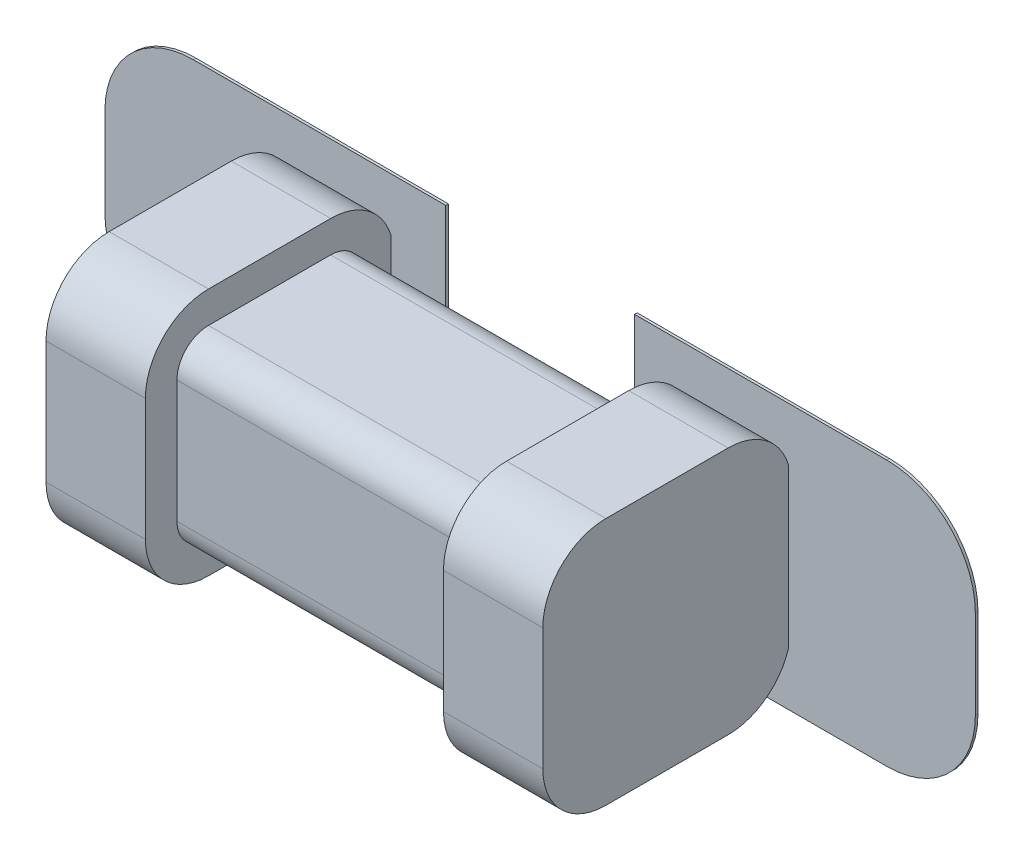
ISO-10303-21;
HEADER;
FILE_DESCRIPTION(('STEP AP214'),'2;1');
FILE_NAME('part.step','',(''),(''),'','','');
FILE_SCHEMA(('AUTOMOTIVE_DESIGN { 1 0 10303 214 1 1 1 1 }'));
ENDSEC;
DATA;
#1=APPLICATION_CONTEXT('core data for automotive mechanical design processes');
#2=APPLICATION_PROTOCOL_DEFINITION('international standard','automotive_design',2000,#1);
#3=PRODUCT_CONTEXT('',#1,'mechanical');
#4=PRODUCT('Part','Part','',(#3));
#5=PRODUCT_RELATED_PRODUCT_CATEGORY('part','',(#4));
#6=PRODUCT_DEFINITION_FORMATION('','',#4);
#7=PRODUCT_DEFINITION_CONTEXT('part definition',#1,'design');
#8=PRODUCT_DEFINITION('design','',#6,#7);
#9=PRODUCT_DEFINITION_SHAPE('','',#8);
#10=(LENGTH_UNIT() NAMED_UNIT(*) SI_UNIT(.MILLI.,.METRE.));
#11=(NAMED_UNIT(*) PLANE_ANGLE_UNIT() SI_UNIT($,.RADIAN.));
#12=(NAMED_UNIT(*) SI_UNIT($,.STERADIAN.) SOLID_ANGLE_UNIT());
#13=UNCERTAINTY_MEASURE_WITH_UNIT(LENGTH_MEASURE(1.E-05),#10,'distance_accuracy_value','');
#14=(GEOMETRIC_REPRESENTATION_CONTEXT(3) GLOBAL_UNCERTAINTY_ASSIGNED_CONTEXT((#13)) GLOBAL_UNIT_ASSIGNED_CONTEXT((#10,
#11,#12)) REPRESENTATION_CONTEXT('',''));
#15=CARTESIAN_POINT('',(0.,0.,0.));
#16=DIRECTION('',(0.,0.,1.));
#17=DIRECTION('',(1.,0.,0.));
#18=AXIS2_PLACEMENT_3D('',#15,#16,#17);
#19=CARTESIAN_POINT('',(0.,0.,0.0762));
#20=DIRECTION('',(0.,0.,1.));
#21=DIRECTION('',(1.,0.,0.));
#22=AXIS2_PLACEMENT_3D('',#19,#20,#21);
#23=PLANE('',#22);
#24=CARTESIAN_POINT('',(-0.698058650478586,-0.0890682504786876,0.0762));
#25=DIRECTION('',(0.,0.,1.));
#26=DIRECTION('',(1.,0.,0.));
#27=AXIS2_PLACEMENT_3D('',#24,#25,#26);
#28=CIRCLE('',#27,0.177936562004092);
#29=CARTESIAN_POINT('',(-0.875995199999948,-0.0890016,0.0762));
#30=VERTEX_POINT('',#29);
#31=CARTESIAN_POINT('',(-0.697992,-0.267004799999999,0.0762));
#32=VERTEX_POINT('',#31);
#33=EDGE_CURVE('E268',#30,#32,#28,.T.);
#34=ORIENTED_EDGE('',*,*,#33,.F.);
#35=DIRECTION('',(0.,1.,0.));
#36=VECTOR('',#35,1.);
#37=CARTESIAN_POINT('',(-0.8759952,0.0890016,0.0762));
#38=LINE('',#37,#36);
#39=CARTESIAN_POINT('',(-0.875995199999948,0.0890016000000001,0.0762));
#40=VERTEX_POINT('',#39);
#41=EDGE_CURVE('E262',#40,#30,#38,.F.);
#42=ORIENTED_EDGE('',*,*,#41,.F.);
#43=CARTESIAN_POINT('',(-0.698058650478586,0.0890682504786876,0.0762));
#44=DIRECTION('',(0.,0.,1.));
#45=DIRECTION('',(1.,0.,0.));
#46=AXIS2_PLACEMENT_3D('',#43,#44,#45);
#47=CIRCLE('',#46,0.177936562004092);
#48=CARTESIAN_POINT('',(-0.697992,0.267004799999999,0.0762));
#49=VERTEX_POINT('',#48);
#50=EDGE_CURVE('E19',#49,#40,#47,.T.);
#51=ORIENTED_EDGE('',*,*,#50,.F.);
#52=DIRECTION('',(1.,0.,0.));
#53=VECTOR('',#52,1.);
#54=CARTESIAN_POINT('',(-0.189992,0.2670048,0.0762));
#55=LINE('',#54,#53);
#56=CARTESIAN_POINT('',(-0.189992,0.2670048,0.0762));
#57=VERTEX_POINT('',#56);
#58=EDGE_CURVE('E245',#57,#49,#55,.F.);
#59=ORIENTED_EDGE('',*,*,#58,.F.);
#60=DIRECTION('',(0.,1.,0.));
#61=VECTOR('',#60,1.);
#62=CARTESIAN_POINT('',(-0.189992,-0.2670048,0.0762));
#63=LINE('',#62,#61);
#64=CARTESIAN_POINT('',(-0.189992,-0.2670048,0.0762));
#65=VERTEX_POINT('',#64);
#66=EDGE_CURVE('E408',#65,#57,#63,.T.);
#67=ORIENTED_EDGE('',*,*,#66,.F.);
#68=DIRECTION('',(1.,0.,0.));
#69=VECTOR('',#68,1.);
#70=CARTESIAN_POINT('',(-0.697992,-0.2670048,0.0762));
#71=LINE('',#70,#69);
#72=EDGE_CURVE('E395',#32,#65,#71,.T.);
#73=ORIENTED_EDGE('',*,*,#72,.F.);
#74=EDGE_LOOP('',(#34,#42,#51,#59,#67,#73));
#75=FACE_BOUND('',#74,.T.);
#76=ADVANCED_FACE('F16',(#75),#23,.F.);
#77=CARTESIAN_POINT('',(-0.189992,0.2670048,0.0762));
#78=DIRECTION('',(0.,1.,0.));
#79=DIRECTION('',(0.,0.,1.));
#80=AXIS2_PLACEMENT_3D('',#77,#78,#79);
#81=PLANE('',#80);
#82=DIRECTION('',(0.,0.,-1.));
#83=VECTOR('',#82,1.);
#84=CARTESIAN_POINT('',(-0.189992,0.2670048,0.0762));
#85=LINE('',#84,#83);
#86=CARTESIAN_POINT('',(-0.189992,0.2670048,0.081534));
#87=VERTEX_POINT('',#86);
#88=EDGE_CURVE('E399',#57,#87,#85,.F.);
#89=ORIENTED_EDGE('',*,*,#88,.F.);
#90=ORIENTED_EDGE('',*,*,#58,.T.);
#91=DIRECTION('',(0.,0.,1.));
#92=VECTOR('',#91,1.);
#93=CARTESIAN_POINT('',(-0.697992,0.267004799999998,0.0762));
#94=LINE('',#93,#92);
#95=CARTESIAN_POINT('',(-0.697992,0.267004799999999,0.081534));
#96=VERTEX_POINT('',#95);
#97=EDGE_CURVE('E256',#96,#49,#94,.F.);
#98=ORIENTED_EDGE('',*,*,#97,.F.);
#99=DIRECTION('',(1.,0.,0.));
#100=VECTOR('',#99,1.);
#101=CARTESIAN_POINT('',(0.,0.2670048,0.081534));
#102=LINE('',#101,#100);
#103=EDGE_CURVE('E390',#87,#96,#102,.F.);
#104=ORIENTED_EDGE('',*,*,#103,.F.);
#105=EDGE_LOOP('',(#89,#90,#98,#104));
#106=FACE_BOUND('',#105,.T.);
#107=ADVANCED_FACE('F457',(#106),#81,.T.);
#108=CARTESIAN_POINT('',(-0.698058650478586,0.0890682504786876,0.0762));
#109=DIRECTION('',(0.,0.,1.));
#110=DIRECTION('',(1.,0.,0.));
#111=AXIS2_PLACEMENT_3D('',#108,#109,#110);
#112=CYLINDRICAL_SURFACE('',#111,0.177936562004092);
#113=ORIENTED_EDGE('',*,*,#97,.T.);
#114=ORIENTED_EDGE('',*,*,#50,.T.);
#115=DIRECTION('',(0.,0.,1.));
#116=VECTOR('',#115,1.);
#117=CARTESIAN_POINT('',(-0.8759952,0.0890016,0.0762));
#118=LINE('',#117,#116);
#119=CARTESIAN_POINT('',(-0.875995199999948,0.0890016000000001,0.081534));
#120=VERTEX_POINT('',#119);
#121=EDGE_CURVE('E254',#120,#40,#118,.F.);
#122=ORIENTED_EDGE('',*,*,#121,.F.);
#123=CARTESIAN_POINT('',(-0.698058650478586,0.0890682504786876,0.081534));
#124=DIRECTION('',(0.,0.,1.));
#125=DIRECTION('',(1.,0.,0.));
#126=AXIS2_PLACEMENT_3D('',#123,#124,#125);
#127=CIRCLE('',#126,0.177936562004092);
#128=EDGE_CURVE('E389',#96,#120,#127,.T.);
#129=ORIENTED_EDGE('',*,*,#128,.F.);
#130=EDGE_LOOP('',(#113,#114,#122,#129));
#131=FACE_BOUND('',#130,.T.);
#132=ADVANCED_FACE('F252',(#131),#112,.T.);
#133=CARTESIAN_POINT('',(-0.8759952,0.0890016,0.0762));
#134=DIRECTION('',(-1.,0.,0.));
#135=DIRECTION('',(0.,0.,1.));
#136=AXIS2_PLACEMENT_3D('',#133,#134,#135);
#137=PLANE('',#136);
#138=ORIENTED_EDGE('',*,*,#121,.T.);
#139=ORIENTED_EDGE('',*,*,#41,.T.);
#140=DIRECTION('',(0.,0.,1.));
#141=VECTOR('',#140,1.);
#142=CARTESIAN_POINT('',(-0.875995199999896,-0.0890016,0.0762));
#143=LINE('',#142,#141);
#144=CARTESIAN_POINT('',(-0.875995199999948,-0.0890016,0.081534));
#145=VERTEX_POINT('',#144);
#146=EDGE_CURVE('E269',#145,#30,#143,.F.);
#147=ORIENTED_EDGE('',*,*,#146,.F.);
#148=DIRECTION('',(0.,1.,0.));
#149=VECTOR('',#148,1.);
#150=CARTESIAN_POINT('',(-0.8759952,0.,0.081534));
#151=LINE('',#150,#149);
#152=EDGE_CURVE('E264',#120,#145,#151,.F.);
#153=ORIENTED_EDGE('',*,*,#152,.F.);
#154=EDGE_LOOP('',(#138,#139,#147,#153));
#155=FACE_BOUND('',#154,.T.);
#156=ADVANCED_FACE('F260',(#155),#137,.T.);
#157=CARTESIAN_POINT('',(-0.698058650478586,-0.0890682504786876,0.0762));
#158=DIRECTION('',(0.,0.,1.));
#159=DIRECTION('',(1.,0.,0.));
#160=AXIS2_PLACEMENT_3D('',#157,#158,#159);
#161=CYLINDRICAL_SURFACE('',#160,0.177936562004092);
#162=ORIENTED_EDGE('',*,*,#146,.T.);
#163=ORIENTED_EDGE('',*,*,#33,.T.);
#164=DIRECTION('',(0.,0.,-1.));
#165=VECTOR('',#164,1.);
#166=CARTESIAN_POINT('',(-0.697992,-0.2670048,0.0762));
#167=LINE('',#166,#165);
#168=CARTESIAN_POINT('',(-0.697992,-0.267004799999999,0.081534));
#169=VERTEX_POINT('',#168);
#170=EDGE_CURVE('E391',#169,#32,#167,.T.);
#171=ORIENTED_EDGE('',*,*,#170,.F.);
#172=CARTESIAN_POINT('',(-0.698058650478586,-0.0890682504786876,0.081534));
#173=DIRECTION('',(0.,0.,1.));
#174=DIRECTION('',(1.,0.,0.));
#175=AXIS2_PLACEMENT_3D('',#172,#173,#174);
#176=CIRCLE('',#175,0.177936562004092);
#177=EDGE_CURVE('E386',#145,#169,#176,.T.);
#178=ORIENTED_EDGE('',*,*,#177,.F.);
#179=EDGE_LOOP('',(#162,#163,#171,#178));
#180=FACE_BOUND('',#179,.T.);
#181=ADVANCED_FACE('F458',(#180),#161,.T.);
#182=CARTESIAN_POINT('',(-0.697992,-0.2670048,0.0762));
#183=DIRECTION('',(0.,-1.,0.));
#184=DIRECTION('',(0.,0.,-1.));
#185=AXIS2_PLACEMENT_3D('',#182,#183,#184);
#186=PLANE('',#185);
#187=ORIENTED_EDGE('',*,*,#170,.T.);
#188=ORIENTED_EDGE('',*,*,#72,.T.);
#189=DIRECTION('',(0.,0.,-1.));
#190=VECTOR('',#189,1.);
#191=CARTESIAN_POINT('',(-0.189992,-0.2670048,0.0762));
#192=LINE('',#191,#190);
#193=CARTESIAN_POINT('',(-0.189992,-0.2670048,0.081534));
#194=VERTEX_POINT('',#193);
#195=EDGE_CURVE('E405',#194,#65,#192,.T.);
#196=ORIENTED_EDGE('',*,*,#195,.F.);
#197=DIRECTION('',(1.,0.,0.));
#198=VECTOR('',#197,1.);
#199=CARTESIAN_POINT('',(0.,-0.2670048,0.081534));
#200=LINE('',#199,#198);
#201=EDGE_CURVE('E388',#169,#194,#200,.T.);
#202=ORIENTED_EDGE('',*,*,#201,.F.);
#203=EDGE_LOOP('',(#187,#188,#196,#202));
#204=FACE_BOUND('',#203,.T.);
#205=ADVANCED_FACE('F455',(#204),#186,.T.);
#206=CARTESIAN_POINT('',(-0.189992,-0.2670048,0.0762));
#207=DIRECTION('',(1.,0.,0.));
#208=DIRECTION('',(0.,0.,-1.));
#209=AXIS2_PLACEMENT_3D('',#206,#207,#208);
#210=PLANE('',#209);
#211=ORIENTED_EDGE('',*,*,#195,.T.);
#212=ORIENTED_EDGE('',*,*,#66,.T.);
#213=ORIENTED_EDGE('',*,*,#88,.T.);
#214=DIRECTION('',(0.,1.,0.));
#215=VECTOR('',#214,1.);
#216=CARTESIAN_POINT('',(-0.189992,0.,0.081534));
#217=LINE('',#216,#215);
#218=EDGE_CURVE('E411',#194,#87,#217,.T.);
#219=ORIENTED_EDGE('',*,*,#218,.F.);
#220=EDGE_LOOP('',(#211,#212,#213,#219));
#221=FACE_BOUND('',#220,.T.);
#222=ADVANCED_FACE('F456',(#221),#210,.T.);
#223=CARTESIAN_POINT('',(-0.500000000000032,0.249999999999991,0.0762));
#224=DIRECTION('',(-1.,0.,0.));
#225=DIRECTION('',(0.,0.,1.));
#226=AXIS2_PLACEMENT_3D('',#223,#224,#225);
#227=PLANE('',#226);
#228=CARTESIAN_POINT('',(-0.500000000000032,0.122999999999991,0.2032));
#229=DIRECTION('',(1.,0.,0.));
#230=DIRECTION('',(0.,0.,-1.));
#231=AXIS2_PLACEMENT_3D('',#228,#229,#230);
#232=CIRCLE('',#231,0.127);
#233=CARTESIAN_POINT('',(-0.500000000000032,0.15941956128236,0.0815340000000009));
#234=VERTEX_POINT('',#233);
#235=CARTESIAN_POINT('',(-0.500000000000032,0.249999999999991,0.2032));
#236=VERTEX_POINT('',#235);
#237=EDGE_CURVE('E369',#234,#236,#232,.T.);
#238=ORIENTED_EDGE('',*,*,#237,.F.);
#239=DIRECTION('',(0.,1.,0.));
#240=VECTOR('',#239,1.);
#241=CARTESIAN_POINT('',(-0.500000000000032,0.,0.081534));
#242=LINE('',#241,#240);
#243=CARTESIAN_POINT('',(-0.500000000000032,-0.15941956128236,0.0815340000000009));
#244=VERTEX_POINT('',#243);
#245=EDGE_CURVE('E385',#244,#234,#242,.T.);
#246=ORIENTED_EDGE('',*,*,#245,.F.);
#247=CARTESIAN_POINT('',(-0.500000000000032,-0.122999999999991,0.2032));
#248=DIRECTION('',(1.,0.,0.));
#249=DIRECTION('',(0.,0.,-1.));
#250=AXIS2_PLACEMENT_3D('',#247,#248,#249);
#251=CIRCLE('',#250,0.127);
#252=CARTESIAN_POINT('',(-0.500000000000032,-0.249999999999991,0.2032));
#253=VERTEX_POINT('',#252);
#254=EDGE_CURVE('E382',#253,#244,#251,.T.);
#255=ORIENTED_EDGE('',*,*,#254,.F.);
#256=DIRECTION('',(0.,0.,-1.));
#257=VECTOR('',#256,1.);
#258=CARTESIAN_POINT('',(-0.500000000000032,-0.249999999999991,0.0762));
#259=LINE('',#258,#257);
#260=CARTESIAN_POINT('',(-0.500000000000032,-0.249999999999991,0.449072));
#261=VERTEX_POINT('',#260);
#262=EDGE_CURVE('E403',#261,#253,#259,.T.);
#263=ORIENTED_EDGE('',*,*,#262,.F.);
#264=CARTESIAN_POINT('',(-0.500000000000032,-0.122999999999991,0.449072));
#265=DIRECTION('',(1.,0.,0.));
#266=DIRECTION('',(0.,0.,-1.));
#267=AXIS2_PLACEMENT_3D('',#264,#265,#266);
#268=CIRCLE('',#267,0.127);
#269=CARTESIAN_POINT('',(-0.500000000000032,-0.122999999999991,0.576072));
#270=VERTEX_POINT('',#269);
#271=EDGE_CURVE('E378',#270,#261,#268,.T.);
#272=ORIENTED_EDGE('',*,*,#271,.F.);
#273=DIRECTION('',(0.,1.,0.));
#274=VECTOR('',#273,1.);
#275=CARTESIAN_POINT('',(-0.500000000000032,0.,0.576072));
#276=LINE('',#275,#274);
#277=CARTESIAN_POINT('',(-0.500000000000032,0.122999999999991,0.576072));
#278=VERTEX_POINT('',#277);
#279=EDGE_CURVE('E436',#278,#270,#276,.F.);
#280=ORIENTED_EDGE('',*,*,#279,.F.);
#281=CARTESIAN_POINT('',(-0.500000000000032,0.122999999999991,0.449072));
#282=DIRECTION('',(-1.,0.,0.));
#283=DIRECTION('',(0.,0.,1.));
#284=AXIS2_PLACEMENT_3D('',#281,#282,#283);
#285=CIRCLE('',#284,0.127);
#286=CARTESIAN_POINT('',(-0.500000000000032,0.249999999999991,0.449072));
#287=VERTEX_POINT('',#286);
#288=EDGE_CURVE('E373',#287,#278,#285,.F.);
#289=ORIENTED_EDGE('',*,*,#288,.F.);
#290=DIRECTION('',(0.,0.,1.));
#291=VECTOR('',#290,1.);
#292=CARTESIAN_POINT('',(-0.500000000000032,0.249999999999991,0.0762));
#293=LINE('',#292,#291);
#294=EDGE_CURVE('E376',#236,#287,#293,.T.);
#295=ORIENTED_EDGE('',*,*,#294,.F.);
#296=EDGE_LOOP('',(#238,#246,#255,#263,#272,#280,#289,#295));
#297=FACE_BOUND('',#296,.T.);
#298=ADVANCED_FACE('F603',(#297),#227,.T.);
#299=CARTESIAN_POINT('',(0.,0.,0.081534));
#300=DIRECTION('',(0.,0.,1.));
#301=DIRECTION('',(1.,0.,0.));
#302=AXIS2_PLACEMENT_3D('',#299,#300,#301);
#303=PLANE('',#302);
#304=DIRECTION('',(1.,0.,0.));
#305=VECTOR('',#304,1.);
#306=CARTESIAN_POINT('',(0.500000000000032,-0.159419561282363,0.0815340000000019));
#307=LINE('',#306,#305);
#308=CARTESIAN_POINT('',(-0.30000000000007,-0.15941956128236,0.0815340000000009));
#309=VERTEX_POINT('',#308);
#310=EDGE_CURVE('E384',#244,#309,#307,.T.);
#311=ORIENTED_EDGE('',*,*,#310,.F.);
#312=ORIENTED_EDGE('',*,*,#245,.T.);
#313=DIRECTION('',(1.,0.,0.));
#314=VECTOR('',#313,1.);
#315=CARTESIAN_POINT('',(0.500000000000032,0.159419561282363,0.0815340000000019));
#316=LINE('',#315,#314);
#317=CARTESIAN_POINT('',(-0.30000000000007,0.15941956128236,0.0815340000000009));
#318=VERTEX_POINT('',#317);
#319=EDGE_CURVE('E950',#318,#234,#316,.F.);
#320=ORIENTED_EDGE('',*,*,#319,.F.);
#321=DIRECTION('',(0.,1.,0.));
#322=VECTOR('',#321,1.);
#323=CARTESIAN_POINT('',(-0.30000000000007,0.249999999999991,0.081534));
#324=LINE('',#323,#322);
#325=EDGE_CURVE('E368',#318,#309,#324,.F.);
#326=ORIENTED_EDGE('',*,*,#325,.T.);
#327=EDGE_LOOP('',(#311,#312,#320,#326));
#328=FACE_BOUND('',#327,.T.);
#329=ORIENTED_EDGE('',*,*,#201,.T.);
#330=ORIENTED_EDGE('',*,*,#218,.T.);
#331=ORIENTED_EDGE('',*,*,#103,.T.);
#332=ORIENTED_EDGE('',*,*,#128,.T.);
#333=ORIENTED_EDGE('',*,*,#152,.T.);
#334=ORIENTED_EDGE('',*,*,#177,.T.);
#335=EDGE_LOOP('',(#329,#330,#331,#332,#333,#334));
#336=FACE_BOUND('',#335,.T.);
#337=ADVANCED_FACE('F452',(#328,#336),#303,.T.);
#338=CARTESIAN_POINT('',(0.500000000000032,-0.122999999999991,0.2032));
#339=DIRECTION('',(1.,0.,0.));
#340=DIRECTION('',(0.,0.,-1.));
#341=AXIS2_PLACEMENT_3D('',#338,#339,#340);
#342=CYLINDRICAL_SURFACE('',#341,0.127);
#343=ORIENTED_EDGE('',*,*,#254,.T.);
#344=ORIENTED_EDGE('',*,*,#310,.T.);
#345=CARTESIAN_POINT('',(-0.30000000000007,-0.122999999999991,0.2032));
#346=DIRECTION('',(1.,0.,0.));
#347=DIRECTION('',(0.,0.,-1.));
#348=AXIS2_PLACEMENT_3D('',#345,#346,#347);
#349=CIRCLE('',#348,0.127);
#350=CARTESIAN_POINT('',(-0.30000000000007,-0.249999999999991,0.2032));
#351=VERTEX_POINT('',#350);
#352=EDGE_CURVE('E365',#309,#351,#349,.F.);
#353=ORIENTED_EDGE('',*,*,#352,.T.);
#354=DIRECTION('',(1.,0.,0.));
#355=VECTOR('',#354,1.);
#356=CARTESIAN_POINT('',(-0.500000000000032,-0.249999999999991,0.2032));
#357=LINE('',#356,#355);
#358=EDGE_CURVE('E381',#253,#351,#357,.T.);
#359=ORIENTED_EDGE('',*,*,#358,.F.);
#360=EDGE_LOOP('',(#343,#344,#353,#359));
#361=FACE_BOUND('',#360,.T.);
#362=ADVANCED_FACE('F596',(#361),#342,.T.);
#363=CARTESIAN_POINT('',(-0.500000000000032,-0.249999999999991,0.0762));
#364=DIRECTION('',(0.,-1.,0.));
#365=DIRECTION('',(0.,0.,-1.));
#366=AXIS2_PLACEMENT_3D('',#363,#364,#365);
#367=PLANE('',#366);
#368=ORIENTED_EDGE('',*,*,#262,.T.);
#369=ORIENTED_EDGE('',*,*,#358,.T.);
#370=DIRECTION('',(0.,0.,1.));
#371=VECTOR('',#370,1.);
#372=CARTESIAN_POINT('',(-0.30000000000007,-0.249999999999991,0.0762));
#373=LINE('',#372,#371);
#374=CARTESIAN_POINT('',(-0.30000000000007,-0.249999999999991,0.449072));
#375=VERTEX_POINT('',#374);
#376=EDGE_CURVE('E364',#351,#375,#373,.T.);
#377=ORIENTED_EDGE('',*,*,#376,.T.);
#378=DIRECTION('',(1.,0.,0.));
#379=VECTOR('',#378,1.);
#380=CARTESIAN_POINT('',(-0.503657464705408,-0.249999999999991,0.449072));
#381=LINE('',#380,#379);
#382=EDGE_CURVE('E380',#261,#375,#381,.T.);
#383=ORIENTED_EDGE('',*,*,#382,.F.);
#384=EDGE_LOOP('',(#368,#369,#377,#383));
#385=FACE_BOUND('',#384,.T.);
#386=ADVANCED_FACE('F593',(#385),#367,.T.);
#387=CARTESIAN_POINT('',(-0.503657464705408,-0.122999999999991,0.449072));
#388=DIRECTION('',(1.,0.,0.));
#389=DIRECTION('',(0.,0.,-1.));
#390=AXIS2_PLACEMENT_3D('',#387,#388,#389);
#391=CYLINDRICAL_SURFACE('',#390,0.127);
#392=ORIENTED_EDGE('',*,*,#382,.T.);
#393=CARTESIAN_POINT('',(-0.30000000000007,-0.122999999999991,0.449072));
#394=DIRECTION('',(1.,0.,0.));
#395=DIRECTION('',(0.,0.,-1.));
#396=AXIS2_PLACEMENT_3D('',#393,#394,#395);
#397=CIRCLE('',#396,0.127);
#398=CARTESIAN_POINT('',(-0.30000000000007,-0.122999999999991,0.576072));
#399=VERTEX_POINT('',#398);
#400=EDGE_CURVE('E361',#375,#399,#397,.F.);
#401=ORIENTED_EDGE('',*,*,#400,.T.);
#402=DIRECTION('',(1.,0.,0.));
#403=VECTOR('',#402,1.);
#404=CARTESIAN_POINT('',(0.,-0.122999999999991,0.576072));
#405=LINE('',#404,#403);
#406=EDGE_CURVE('E437',#270,#399,#405,.T.);
#407=ORIENTED_EDGE('',*,*,#406,.F.);
#408=ORIENTED_EDGE('',*,*,#271,.T.);
#409=EDGE_LOOP('',(#392,#401,#407,#408));
#410=FACE_BOUND('',#409,.T.);
#411=ADVANCED_FACE('F590',(#410),#391,.T.);
#412=CARTESIAN_POINT('',(0.,0.,0.576072));
#413=DIRECTION('',(0.,0.,1.));
#414=DIRECTION('',(1.,0.,0.));
#415=AXIS2_PLACEMENT_3D('',#412,#413,#414);
#416=PLANE('',#415);
#417=DIRECTION('',(0.,1.,0.));
#418=VECTOR('',#417,1.);
#419=CARTESIAN_POINT('',(-0.30000000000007,0.249999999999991,0.576072));
#420=LINE('',#419,#418);
#421=CARTESIAN_POINT('',(-0.30000000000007,0.122999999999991,0.576072));
#422=VERTEX_POINT('',#421);
#423=EDGE_CURVE('E360',#399,#422,#420,.T.);
#424=ORIENTED_EDGE('',*,*,#423,.T.);
#425=DIRECTION('',(-1.,0.,0.));
#426=VECTOR('',#425,1.);
#427=CARTESIAN_POINT('',(0.503516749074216,0.122999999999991,0.576072));
#428=LINE('',#427,#426);
#429=EDGE_CURVE('E377',#278,#422,#428,.F.);
#430=ORIENTED_EDGE('',*,*,#429,.F.);
#431=ORIENTED_EDGE('',*,*,#279,.T.);
#432=ORIENTED_EDGE('',*,*,#406,.T.);
#433=EDGE_LOOP('',(#424,#430,#431,#432));
#434=FACE_BOUND('',#433,.T.);
#435=ADVANCED_FACE('F586',(#434),#416,.T.);
#436=CARTESIAN_POINT('',(0.503516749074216,0.122999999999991,0.449072));
#437=DIRECTION('',(-1.,0.,0.));
#438=DIRECTION('',(0.,0.,1.));
#439=AXIS2_PLACEMENT_3D('',#436,#437,#438);
#440=CYLINDRICAL_SURFACE('',#439,0.127);
#441=DIRECTION('',(1.,0.,0.));
#442=VECTOR('',#441,1.);
#443=CARTESIAN_POINT('',(0.500000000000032,0.249999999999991,0.449072));
#444=LINE('',#443,#442);
#445=CARTESIAN_POINT('',(-0.30000000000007,0.249999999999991,0.449072));
#446=VERTEX_POINT('',#445);
#447=EDGE_CURVE('E372',#287,#446,#444,.T.);
#448=ORIENTED_EDGE('',*,*,#447,.F.);
#449=ORIENTED_EDGE('',*,*,#288,.T.);
#450=ORIENTED_EDGE('',*,*,#429,.T.);
#451=CARTESIAN_POINT('',(-0.30000000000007,0.122999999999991,0.449072));
#452=DIRECTION('',(-1.,0.,0.));
#453=DIRECTION('',(0.,0.,1.));
#454=AXIS2_PLACEMENT_3D('',#451,#452,#453);
#455=CIRCLE('',#454,0.127);
#456=EDGE_CURVE('E357',#422,#446,#455,.T.);
#457=ORIENTED_EDGE('',*,*,#456,.T.);
#458=EDGE_LOOP('',(#448,#449,#450,#457));
#459=FACE_BOUND('',#458,.T.);
#460=ADVANCED_FACE('F582',(#459),#440,.T.);
#461=CARTESIAN_POINT('',(0.500000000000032,0.249999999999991,0.0762));
#462=DIRECTION('',(0.,1.,0.));
#463=DIRECTION('',(0.,0.,1.));
#464=AXIS2_PLACEMENT_3D('',#461,#462,#463);
#465=PLANE('',#464);
#466=DIRECTION('',(0.,0.,1.));
#467=VECTOR('',#466,1.);
#468=CARTESIAN_POINT('',(-0.30000000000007,0.249999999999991,0.0762));
#469=LINE('',#468,#467);
#470=CARTESIAN_POINT('',(-0.30000000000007,0.249999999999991,0.2032));
#471=VERTEX_POINT('',#470);
#472=EDGE_CURVE('E356',#446,#471,#469,.F.);
#473=ORIENTED_EDGE('',*,*,#472,.T.);
#474=DIRECTION('',(1.,0.,0.));
#475=VECTOR('',#474,1.);
#476=CARTESIAN_POINT('',(0.500000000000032,0.249999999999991,0.2032));
#477=LINE('',#476,#475);
#478=EDGE_CURVE('E371',#236,#471,#477,.T.);
#479=ORIENTED_EDGE('',*,*,#478,.F.);
#480=ORIENTED_EDGE('',*,*,#294,.T.);
#481=ORIENTED_EDGE('',*,*,#447,.T.);
#482=EDGE_LOOP('',(#473,#479,#480,#481));
#483=FACE_BOUND('',#482,.T.);
#484=ADVANCED_FACE('F578',(#483),#465,.T.);
#485=CARTESIAN_POINT('',(0.500000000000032,0.122999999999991,0.2032));
#486=DIRECTION('',(1.,0.,0.));
#487=DIRECTION('',(0.,0.,-1.));
#488=AXIS2_PLACEMENT_3D('',#485,#486,#487);
#489=CYLINDRICAL_SURFACE('',#488,0.127);
#490=CARTESIAN_POINT('',(-0.30000000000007,0.122999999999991,0.2032));
#491=DIRECTION('',(1.,0.,0.));
#492=DIRECTION('',(0.,0.,-1.));
#493=AXIS2_PLACEMENT_3D('',#490,#491,#492);
#494=CIRCLE('',#493,0.127);
#495=EDGE_CURVE('E353',#471,#318,#494,.F.);
#496=ORIENTED_EDGE('',*,*,#495,.T.);
#497=ORIENTED_EDGE('',*,*,#319,.T.);
#498=ORIENTED_EDGE('',*,*,#237,.T.);
#499=ORIENTED_EDGE('',*,*,#478,.T.);
#500=EDGE_LOOP('',(#496,#497,#498,#499));
#501=FACE_BOUND('',#500,.T.);
#502=ADVANCED_FACE('F574',(#501),#489,.T.);
#503=CARTESIAN_POINT('',(-0.30000000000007,0.249999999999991,0.0762));
#504=DIRECTION('',(-1.,0.,0.));
#505=DIRECTION('',(0.,0.,1.));
#506=AXIS2_PLACEMENT_3D('',#503,#504,#505);
#507=PLANE('',#506);
#508=DIRECTION('',(0.,1.,0.));
#509=VECTOR('',#508,1.);
#510=CARTESIAN_POINT('',(-0.30000000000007,0.249999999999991,0.1397));
#511=LINE('',#510,#509);
#512=CARTESIAN_POINT('',(-0.30000000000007,0.122999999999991,0.1397));
#513=VERTEX_POINT('',#512);
#514=CARTESIAN_POINT('',(-0.30000000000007,-0.122999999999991,0.1397));
#515=VERTEX_POINT('',#514);
#516=EDGE_CURVE('E344',#513,#515,#511,.F.);
#517=ORIENTED_EDGE('',*,*,#516,.T.);
#518=CARTESIAN_POINT('',(-0.30000000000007,-0.122999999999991,0.2032));
#519=DIRECTION('',(1.,0.,0.));
#520=DIRECTION('',(0.,0.,-1.));
#521=AXIS2_PLACEMENT_3D('',#518,#519,#520);
#522=CIRCLE('',#521,0.0635);
#523=CARTESIAN_POINT('',(-0.30000000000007,-0.186499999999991,0.2032));
#524=VERTEX_POINT('',#523);
#525=EDGE_CURVE('E341',#524,#515,#522,.T.);
#526=ORIENTED_EDGE('',*,*,#525,.F.);
#527=DIRECTION('',(0.,0.,1.));
#528=VECTOR('',#527,1.);
#529=CARTESIAN_POINT('',(-0.30000000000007,-0.186499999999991,0.0762));
#530=LINE('',#529,#528);
#531=CARTESIAN_POINT('',(-0.30000000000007,-0.186499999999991,0.449072));
#532=VERTEX_POINT('',#531);
#533=EDGE_CURVE('E340',#524,#532,#530,.T.);
#534=ORIENTED_EDGE('',*,*,#533,.T.);
#535=CARTESIAN_POINT('',(-0.30000000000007,-0.122999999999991,0.449072));
#536=DIRECTION('',(-1.,0.,0.));
#537=DIRECTION('',(0.,0.,1.));
#538=AXIS2_PLACEMENT_3D('',#535,#536,#537);
#539=CIRCLE('',#538,0.0635);
#540=CARTESIAN_POINT('',(-0.30000000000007,-0.122999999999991,0.512572));
#541=VERTEX_POINT('',#540);
#542=EDGE_CURVE('E337',#541,#532,#539,.F.);
#543=ORIENTED_EDGE('',*,*,#542,.F.);
#544=DIRECTION('',(0.,1.,0.));
#545=VECTOR('',#544,1.);
#546=CARTESIAN_POINT('',(-0.30000000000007,0.249999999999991,0.512572));
#547=LINE('',#546,#545);
#548=CARTESIAN_POINT('',(-0.30000000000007,0.122999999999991,0.512572));
#549=VERTEX_POINT('',#548);
#550=EDGE_CURVE('E352',#541,#549,#547,.T.);
#551=ORIENTED_EDGE('',*,*,#550,.T.);
#552=CARTESIAN_POINT('',(-0.30000000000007,0.122999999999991,0.449072));
#553=DIRECTION('',(1.,0.,0.));
#554=DIRECTION('',(0.,0.,-1.));
#555=AXIS2_PLACEMENT_3D('',#552,#553,#554);
#556=CIRCLE('',#555,0.0635);
#557=CARTESIAN_POINT('',(-0.30000000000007,0.186499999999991,0.449072));
#558=VERTEX_POINT('',#557);
#559=EDGE_CURVE('E349',#558,#549,#556,.T.);
#560=ORIENTED_EDGE('',*,*,#559,.F.);
#561=DIRECTION('',(0.,0.,-1.));
#562=VECTOR('',#561,1.);
#563=CARTESIAN_POINT('',(-0.30000000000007,0.186499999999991,0.0762));
#564=LINE('',#563,#562);
#565=CARTESIAN_POINT('',(-0.30000000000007,0.186499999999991,0.2032));
#566=VERTEX_POINT('',#565);
#567=EDGE_CURVE('E348',#558,#566,#564,.T.);
#568=ORIENTED_EDGE('',*,*,#567,.T.);
#569=CARTESIAN_POINT('',(-0.30000000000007,0.122999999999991,0.2032));
#570=DIRECTION('',(-1.,0.,0.));
#571=DIRECTION('',(0.,0.,1.));
#572=AXIS2_PLACEMENT_3D('',#569,#570,#571);
#573=CIRCLE('',#572,0.0635);
#574=EDGE_CURVE('E345',#513,#566,#573,.F.);
#575=ORIENTED_EDGE('',*,*,#574,.F.);
#576=EDGE_LOOP('',(#517,#526,#534,#543,#551,#560,#568,#575));
#577=FACE_BOUND('',#576,.T.);
#578=ORIENTED_EDGE('',*,*,#472,.F.);
#579=ORIENTED_EDGE('',*,*,#456,.F.);
#580=ORIENTED_EDGE('',*,*,#423,.F.);
#581=ORIENTED_EDGE('',*,*,#400,.F.);
#582=ORIENTED_EDGE('',*,*,#376,.F.);
#583=ORIENTED_EDGE('',*,*,#352,.F.);
#584=ORIENTED_EDGE('',*,*,#325,.F.);
#585=ORIENTED_EDGE('',*,*,#495,.F.);
#586=EDGE_LOOP('',(#578,#579,#580,#581,#582,#583,#584,#585));
#587=FACE_BOUND('',#586,.T.);
#588=ADVANCED_FACE('F570',(#577,#587),#507,.F.);
#589=CARTESIAN_POINT('',(0.30000000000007,0.249999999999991,0.512572));
#590=DIRECTION('',(0.,0.,-1.));
#591=DIRECTION('',(-1.,0.,0.));
#592=AXIS2_PLACEMENT_3D('',#589,#590,#591);
#593=PLANE('',#592);
#594=DIRECTION('',(-1.,0.,0.));
#595=VECTOR('',#594,1.);
#596=CARTESIAN_POINT('',(0.303657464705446,-0.122999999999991,0.512572));
#597=LINE('',#596,#595);
#598=CARTESIAN_POINT('',(0.30000000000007,-0.122999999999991,0.512572));
#599=VERTEX_POINT('',#598);
#600=EDGE_CURVE('E993',#599,#541,#597,.T.);
#601=ORIENTED_EDGE('',*,*,#600,.F.);
#602=DIRECTION('',(0.,1.,0.));
#603=VECTOR('',#602,1.);
#604=CARTESIAN_POINT('',(0.30000000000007,0.186499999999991,0.512572));
#605=LINE('',#604,#603);
#606=CARTESIAN_POINT('',(0.30000000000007,0.122999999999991,0.512572));
#607=VERTEX_POINT('',#606);
#608=EDGE_CURVE('E324',#599,#607,#605,.T.);
#609=ORIENTED_EDGE('',*,*,#608,.T.);
#610=DIRECTION('',(1.,0.,0.));
#611=VECTOR('',#610,1.);
#612=CARTESIAN_POINT('',(-0.303833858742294,0.122999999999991,0.512572));
#613=LINE('',#612,#611);
#614=EDGE_CURVE('E351',#549,#607,#613,.T.);
#615=ORIENTED_EDGE('',*,*,#614,.F.);
#616=ORIENTED_EDGE('',*,*,#550,.F.);
#617=EDGE_LOOP('',(#601,#609,#615,#616));
#618=FACE_BOUND('',#617,.T.);
#619=ADVANCED_FACE('F566',(#618),#593,.F.);
#620=CARTESIAN_POINT('',(-0.303833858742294,0.122999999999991,0.449072));
#621=DIRECTION('',(1.,0.,0.));
#622=DIRECTION('',(0.,0.,-1.));
#623=AXIS2_PLACEMENT_3D('',#620,#621,#622);
#624=CYLINDRICAL_SURFACE('',#623,0.0635);
#625=ORIENTED_EDGE('',*,*,#559,.T.);
#626=ORIENTED_EDGE('',*,*,#614,.T.);
#627=CARTESIAN_POINT('',(0.30000000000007,0.122999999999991,0.449072));
#628=DIRECTION('',(1.,0.,0.));
#629=DIRECTION('',(0.,0.,-1.));
#630=AXIS2_PLACEMENT_3D('',#627,#628,#629);
#631=CIRCLE('',#630,0.0635);
#632=CARTESIAN_POINT('',(0.30000000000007,0.186499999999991,0.449072));
#633=VERTEX_POINT('',#632);
#634=EDGE_CURVE('E321',#607,#633,#631,.F.);
#635=ORIENTED_EDGE('',*,*,#634,.T.);
#636=DIRECTION('',(1.,0.,0.));
#637=VECTOR('',#636,1.);
#638=CARTESIAN_POINT('',(-0.30000000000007,0.186499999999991,0.449072));
#639=LINE('',#638,#637);
#640=EDGE_CURVE('E974',#633,#558,#639,.F.);
#641=ORIENTED_EDGE('',*,*,#640,.T.);
#642=EDGE_LOOP('',(#625,#626,#635,#641));
#643=FACE_BOUND('',#642,.T.);
#644=ADVANCED_FACE('F562',(#643),#624,.T.);
#645=CARTESIAN_POINT('',(-0.30000000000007,0.186499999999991,0.0762));
#646=DIRECTION('',(0.,-1.,0.));
#647=DIRECTION('',(0.,0.,-1.));
#648=AXIS2_PLACEMENT_3D('',#645,#646,#647);
#649=PLANE('',#648);
#650=ORIENTED_EDGE('',*,*,#640,.F.);
#651=DIRECTION('',(0.,0.,-1.));
#652=VECTOR('',#651,1.);
#653=CARTESIAN_POINT('',(0.30000000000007,0.186499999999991,0.0762));
#654=LINE('',#653,#652);
#655=CARTESIAN_POINT('',(0.30000000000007,0.186499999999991,0.2032));
#656=VERTEX_POINT('',#655);
#657=EDGE_CURVE('E320',#633,#656,#654,.T.);
#658=ORIENTED_EDGE('',*,*,#657,.T.);
#659=DIRECTION('',(-1.,0.,0.));
#660=VECTOR('',#659,1.);
#661=CARTESIAN_POINT('',(0.303516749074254,0.186499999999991,0.2032));
#662=LINE('',#661,#660);
#663=EDGE_CURVE('E347',#566,#656,#662,.F.);
#664=ORIENTED_EDGE('',*,*,#663,.F.);
#665=ORIENTED_EDGE('',*,*,#567,.F.);
#666=EDGE_LOOP('',(#650,#658,#664,#665));
#667=FACE_BOUND('',#666,.T.);
#668=ADVANCED_FACE('F558',(#667),#649,.F.);
#669=CARTESIAN_POINT('',(0.303516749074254,0.122999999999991,0.2032));
#670=DIRECTION('',(-1.,0.,0.));
#671=DIRECTION('',(0.,0.,1.));
#672=AXIS2_PLACEMENT_3D('',#669,#670,#671);
#673=CYLINDRICAL_SURFACE('',#672,0.0635);
#674=CARTESIAN_POINT('',(0.30000000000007,0.122999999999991,0.2032));
#675=DIRECTION('',(-1.,0.,0.));
#676=DIRECTION('',(0.,0.,1.));
#677=AXIS2_PLACEMENT_3D('',#674,#675,#676);
#678=CIRCLE('',#677,0.0635);
#679=CARTESIAN_POINT('',(0.30000000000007,0.122999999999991,0.1397));
#680=VERTEX_POINT('',#679);
#681=EDGE_CURVE('E317',#656,#680,#678,.T.);
#682=ORIENTED_EDGE('',*,*,#681,.T.);
#683=DIRECTION('',(1.,0.,0.));
#684=VECTOR('',#683,1.);
#685=CARTESIAN_POINT('',(-0.30000000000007,0.122999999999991,0.1397));
#686=LINE('',#685,#684);
#687=EDGE_CURVE('E972',#680,#513,#686,.F.);
#688=ORIENTED_EDGE('',*,*,#687,.T.);
#689=ORIENTED_EDGE('',*,*,#574,.T.);
#690=ORIENTED_EDGE('',*,*,#663,.T.);
#691=EDGE_LOOP('',(#682,#688,#689,#690));
#692=FACE_BOUND('',#691,.T.);
#693=ADVANCED_FACE('F554',(#692),#673,.T.);
#694=CARTESIAN_POINT('',(-0.30000000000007,0.249999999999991,0.1397));
#695=DIRECTION('',(0.,0.,1.));
#696=DIRECTION('',(1.,0.,0.));
#697=AXIS2_PLACEMENT_3D('',#694,#695,#696);
#698=PLANE('',#697);
#699=DIRECTION('',(1.,0.,0.));
#700=VECTOR('',#699,1.);
#701=CARTESIAN_POINT('',(-0.303516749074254,-0.122999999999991,0.1397));
#702=LINE('',#701,#700);
#703=CARTESIAN_POINT('',(0.30000000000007,-0.122999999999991,0.1397));
#704=VERTEX_POINT('',#703);
#705=EDGE_CURVE('E343',#515,#704,#702,.T.);
#706=ORIENTED_EDGE('',*,*,#705,.F.);
#707=ORIENTED_EDGE('',*,*,#516,.F.);
#708=ORIENTED_EDGE('',*,*,#687,.F.);
#709=DIRECTION('',(0.,1.,0.));
#710=VECTOR('',#709,1.);
#711=CARTESIAN_POINT('',(0.30000000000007,0.186499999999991,0.1397));
#712=LINE('',#711,#710);
#713=EDGE_CURVE('E316',#680,#704,#712,.F.);
#714=ORIENTED_EDGE('',*,*,#713,.T.);
#715=EDGE_LOOP('',(#706,#707,#708,#714));
#716=FACE_BOUND('',#715,.T.);
#717=ADVANCED_FACE('F550',(#716),#698,.F.);
#718=CARTESIAN_POINT('',(-0.303516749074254,-0.122999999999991,0.2032));
#719=DIRECTION('',(1.,0.,0.));
#720=DIRECTION('',(0.,0.,-1.));
#721=AXIS2_PLACEMENT_3D('',#718,#719,#720);
#722=CYLINDRICAL_SURFACE('',#721,0.0635);
#723=ORIENTED_EDGE('',*,*,#525,.T.);
#724=ORIENTED_EDGE('',*,*,#705,.T.);
#725=CARTESIAN_POINT('',(0.30000000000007,-0.122999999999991,0.2032));
#726=DIRECTION('',(1.,0.,0.));
#727=DIRECTION('',(0.,0.,-1.));
#728=AXIS2_PLACEMENT_3D('',#725,#726,#727);
#729=CIRCLE('',#728,0.0635);
#730=CARTESIAN_POINT('',(0.30000000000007,-0.186499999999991,0.2032));
#731=VERTEX_POINT('',#730);
#732=EDGE_CURVE('E313',#704,#731,#729,.F.);
#733=ORIENTED_EDGE('',*,*,#732,.T.);
#734=DIRECTION('',(1.,0.,0.));
#735=VECTOR('',#734,1.);
#736=CARTESIAN_POINT('',(0.30000000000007,-0.186499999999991,0.2032));
#737=LINE('',#736,#735);
#738=EDGE_CURVE('E985',#731,#524,#737,.F.);
#739=ORIENTED_EDGE('',*,*,#738,.T.);
#740=EDGE_LOOP('',(#723,#724,#733,#739));
#741=FACE_BOUND('',#740,.T.);
#742=ADVANCED_FACE('F546',(#741),#722,.T.);
#743=CARTESIAN_POINT('',(0.30000000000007,-0.186499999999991,0.0762));
#744=DIRECTION('',(0.,1.,0.));
#745=DIRECTION('',(0.,0.,1.));
#746=AXIS2_PLACEMENT_3D('',#743,#744,#745);
#747=PLANE('',#746);
#748=ORIENTED_EDGE('',*,*,#738,.F.);
#749=DIRECTION('',(0.,0.,-1.));
#750=VECTOR('',#749,1.);
#751=CARTESIAN_POINT('',(0.30000000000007,-0.186499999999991,0.0762));
#752=LINE('',#751,#750);
#753=CARTESIAN_POINT('',(0.30000000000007,-0.186499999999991,0.449072));
#754=VERTEX_POINT('',#753);
#755=EDGE_CURVE('E312',#731,#754,#752,.F.);
#756=ORIENTED_EDGE('',*,*,#755,.T.);
#757=DIRECTION('',(-1.,0.,0.));
#758=VECTOR('',#757,1.);
#759=CARTESIAN_POINT('',(0.303657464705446,-0.186499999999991,0.449072));
#760=LINE('',#759,#758);
#761=EDGE_CURVE('E339',#532,#754,#760,.F.);
#762=ORIENTED_EDGE('',*,*,#761,.F.);
#763=ORIENTED_EDGE('',*,*,#533,.F.);
#764=EDGE_LOOP('',(#748,#756,#762,#763));
#765=FACE_BOUND('',#764,.T.);
#766=ADVANCED_FACE('F542',(#765),#747,.F.);
#767=CARTESIAN_POINT('',(0.303657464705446,-0.122999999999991,0.449072));
#768=DIRECTION('',(-1.,0.,0.));
#769=DIRECTION('',(0.,0.,1.));
#770=AXIS2_PLACEMENT_3D('',#767,#768,#769);
#771=CYLINDRICAL_SURFACE('',#770,0.0635);
#772=CARTESIAN_POINT('',(0.30000000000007,-0.122999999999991,0.449072));
#773=DIRECTION('',(-1.,0.,0.));
#774=DIRECTION('',(0.,0.,1.));
#775=AXIS2_PLACEMENT_3D('',#772,#773,#774);
#776=CIRCLE('',#775,0.0635);
#777=EDGE_CURVE('E309',#754,#599,#776,.T.);
#778=ORIENTED_EDGE('',*,*,#777,.T.);
#779=ORIENTED_EDGE('',*,*,#600,.T.);
#780=ORIENTED_EDGE('',*,*,#542,.T.);
#781=ORIENTED_EDGE('',*,*,#761,.T.);
#782=EDGE_LOOP('',(#778,#779,#780,#781));
#783=FACE_BOUND('',#782,.T.);
#784=ADVANCED_FACE('F538',(#783),#771,.T.);
#785=CARTESIAN_POINT('',(0.500000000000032,0.249999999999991,0.0762));
#786=DIRECTION('',(0.,1.,0.));
#787=DIRECTION('',(0.,0.,1.));
#788=AXIS2_PLACEMENT_3D('',#785,#786,#787);
#789=PLANE('',#788);
#790=DIRECTION('',(0.,0.,-1.));
#791=VECTOR('',#790,1.);
#792=CARTESIAN_POINT('',(0.500000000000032,0.249999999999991,0.0762));
#793=LINE('',#792,#791);
#794=CARTESIAN_POINT('',(0.500000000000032,0.249999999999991,0.2032));
#795=VERTEX_POINT('',#794);
#796=CARTESIAN_POINT('',(0.500000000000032,0.249999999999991,0.449072));
#797=VERTEX_POINT('',#796);
#798=EDGE_CURVE('E301',#795,#797,#793,.F.);
#799=ORIENTED_EDGE('',*,*,#798,.F.);
#800=DIRECTION('',(1.,0.,0.));
#801=VECTOR('',#800,1.);
#802=CARTESIAN_POINT('',(0.500000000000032,0.249999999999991,0.2032));
#803=LINE('',#802,#801);
#804=CARTESIAN_POINT('',(0.30000000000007,0.249999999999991,0.2032));
#805=VERTEX_POINT('',#804);
#806=EDGE_CURVE('E305',#805,#795,#803,.T.);
#807=ORIENTED_EDGE('',*,*,#806,.F.);
#808=DIRECTION('',(0.,0.,-1.));
#809=VECTOR('',#808,1.);
#810=CARTESIAN_POINT('',(0.30000000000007,0.249999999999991,0.0762));
#811=LINE('',#810,#809);
#812=CARTESIAN_POINT('',(0.30000000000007,0.249999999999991,0.449072));
#813=VERTEX_POINT('',#812);
#814=EDGE_CURVE('E336',#805,#813,#811,.F.);
#815=ORIENTED_EDGE('',*,*,#814,.T.);
#816=DIRECTION('',(-1.,0.,0.));
#817=VECTOR('',#816,1.);
#818=CARTESIAN_POINT('',(0.503516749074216,0.249999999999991,0.449072));
#819=LINE('',#818,#817);
#820=EDGE_CURVE('E1025',#797,#813,#819,.T.);
#821=ORIENTED_EDGE('',*,*,#820,.F.);
#822=EDGE_LOOP('',(#799,#807,#815,#821));
#823=FACE_BOUND('',#822,.T.);
#824=ADVANCED_FACE('F534',(#823),#789,.T.);
#825=CARTESIAN_POINT('',(0.503516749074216,0.122999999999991,0.449072));
#826=DIRECTION('',(-1.,0.,0.));
#827=DIRECTION('',(0.,0.,1.));
#828=AXIS2_PLACEMENT_3D('',#825,#826,#827);
#829=CYLINDRICAL_SURFACE('',#828,0.127);
#830=ORIENTED_EDGE('',*,*,#820,.T.);
#831=CARTESIAN_POINT('',(0.30000000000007,0.122999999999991,0.449072));
#832=DIRECTION('',(-1.,0.,0.));
#833=DIRECTION('',(0.,0.,1.));
#834=AXIS2_PLACEMENT_3D('',#831,#832,#833);
#835=CIRCLE('',#834,0.127);
#836=CARTESIAN_POINT('',(0.30000000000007,0.122999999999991,0.576072));
#837=VERTEX_POINT('',#836);
#838=EDGE_CURVE('E333',#813,#837,#835,.F.);
#839=ORIENTED_EDGE('',*,*,#838,.T.);
#840=DIRECTION('',(1.,0.,0.));
#841=VECTOR('',#840,1.);
#842=CARTESIAN_POINT('',(0.,0.122999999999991,0.576072));
#843=LINE('',#842,#841);
#844=CARTESIAN_POINT('',(0.500000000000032,0.122999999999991,0.576072));
#845=VERTEX_POINT('',#844);
#846=EDGE_CURVE('E1023',#845,#837,#843,.F.);
#847=ORIENTED_EDGE('',*,*,#846,.F.);
#848=CARTESIAN_POINT('',(0.500000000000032,0.122999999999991,0.449072));
#849=DIRECTION('',(-1.,0.,0.));
#850=DIRECTION('',(0.,0.,1.));
#851=AXIS2_PLACEMENT_3D('',#848,#849,#850);
#852=CIRCLE('',#851,0.127);
#853=EDGE_CURVE('E299',#797,#845,#852,.F.);
#854=ORIENTED_EDGE('',*,*,#853,.F.);
#855=EDGE_LOOP('',(#830,#839,#847,#854));
#856=FACE_BOUND('',#855,.T.);
#857=ADVANCED_FACE('F530',(#856),#829,.T.);
#858=CARTESIAN_POINT('',(0.,0.,0.576072));
#859=DIRECTION('',(0.,0.,1.));
#860=DIRECTION('',(1.,0.,0.));
#861=AXIS2_PLACEMENT_3D('',#858,#859,#860);
#862=PLANE('',#861);
#863=DIRECTION('',(0.,1.,0.));
#864=VECTOR('',#863,1.);
#865=CARTESIAN_POINT('',(0.500000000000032,-0.249999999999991,0.576072));
#866=LINE('',#865,#864);
#867=CARTESIAN_POINT('',(0.500000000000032,-0.122999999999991,0.576072));
#868=VERTEX_POINT('',#867);
#869=EDGE_CURVE('E298',#845,#868,#866,.F.);
#870=ORIENTED_EDGE('',*,*,#869,.F.);
#871=ORIENTED_EDGE('',*,*,#846,.T.);
#872=DIRECTION('',(0.,1.,0.));
#873=VECTOR('',#872,1.);
#874=CARTESIAN_POINT('',(0.30000000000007,0.186499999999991,0.576072));
#875=LINE('',#874,#873);
#876=CARTESIAN_POINT('',(0.30000000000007,-0.122999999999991,0.576072));
#877=VERTEX_POINT('',#876);
#878=EDGE_CURVE('E332',#837,#877,#875,.F.);
#879=ORIENTED_EDGE('',*,*,#878,.T.);
#880=DIRECTION('',(1.,0.,0.));
#881=VECTOR('',#880,1.);
#882=CARTESIAN_POINT('',(-0.503657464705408,-0.122999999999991,0.576072));
#883=LINE('',#882,#881);
#884=EDGE_CURVE('E1021',#868,#877,#883,.F.);
#885=ORIENTED_EDGE('',*,*,#884,.F.);
#886=EDGE_LOOP('',(#870,#871,#879,#885));
#887=FACE_BOUND('',#886,.T.);
#888=ADVANCED_FACE('F526',(#887),#862,.T.);
#889=CARTESIAN_POINT('',(-0.503657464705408,-0.122999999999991,0.449072));
#890=DIRECTION('',(1.,0.,0.));
#891=DIRECTION('',(0.,0.,-1.));
#892=AXIS2_PLACEMENT_3D('',#889,#890,#891);
#893=CYLINDRICAL_SURFACE('',#892,0.127);
#894=DIRECTION('',(1.,0.,0.));
#895=VECTOR('',#894,1.);
#896=CARTESIAN_POINT('',(-0.500000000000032,-0.249999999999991,0.449072));
#897=LINE('',#896,#895);
#898=CARTESIAN_POINT('',(0.500000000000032,-0.249999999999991,0.449072));
#899=VERTEX_POINT('',#898);
#900=CARTESIAN_POINT('',(0.30000000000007,-0.249999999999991,0.449072));
#901=VERTEX_POINT('',#900);
#902=EDGE_CURVE('E1019',#899,#901,#897,.F.);
#903=ORIENTED_EDGE('',*,*,#902,.F.);
#904=CARTESIAN_POINT('',(0.500000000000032,-0.122999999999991,0.449072));
#905=DIRECTION('',(1.,0.,0.));
#906=DIRECTION('',(0.,0.,-1.));
#907=AXIS2_PLACEMENT_3D('',#904,#905,#906);
#908=CIRCLE('',#907,0.127);
#909=EDGE_CURVE('E296',#868,#899,#908,.T.);
#910=ORIENTED_EDGE('',*,*,#909,.F.);
#911=ORIENTED_EDGE('',*,*,#884,.T.);
#912=CARTESIAN_POINT('',(0.30000000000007,-0.122999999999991,0.449072));
#913=DIRECTION('',(1.,0.,0.));
#914=DIRECTION('',(0.,0.,-1.));
#915=AXIS2_PLACEMENT_3D('',#912,#913,#914);
#916=CIRCLE('',#915,0.127);
#917=EDGE_CURVE('E329',#877,#901,#916,.T.);
#918=ORIENTED_EDGE('',*,*,#917,.T.);
#919=EDGE_LOOP('',(#903,#910,#911,#918));
#920=FACE_BOUND('',#919,.T.);
#921=ADVANCED_FACE('F522',(#920),#893,.T.);
#922=CARTESIAN_POINT('',(-0.500000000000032,-0.249999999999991,0.0762));
#923=DIRECTION('',(0.,-1.,0.));
#924=DIRECTION('',(0.,0.,-1.));
#925=AXIS2_PLACEMENT_3D('',#922,#923,#924);
#926=PLANE('',#925);
#927=DIRECTION('',(0.,0.,-1.));
#928=VECTOR('',#927,1.);
#929=CARTESIAN_POINT('',(0.30000000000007,-0.249999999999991,0.0762));
#930=LINE('',#929,#928);
#931=CARTESIAN_POINT('',(0.30000000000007,-0.249999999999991,0.2032));
#932=VERTEX_POINT('',#931);
#933=EDGE_CURVE('E328',#901,#932,#930,.T.);
#934=ORIENTED_EDGE('',*,*,#933,.T.);
#935=DIRECTION('',(1.,0.,0.));
#936=VECTOR('',#935,1.);
#937=CARTESIAN_POINT('',(0.500000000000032,-0.249999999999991,0.2032));
#938=LINE('',#937,#936);
#939=CARTESIAN_POINT('',(0.500000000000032,-0.249999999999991,0.2032));
#940=VERTEX_POINT('',#939);
#941=EDGE_CURVE('E1017',#940,#932,#938,.F.);
#942=ORIENTED_EDGE('',*,*,#941,.F.);
#943=DIRECTION('',(0.,0.,-1.));
#944=VECTOR('',#943,1.);
#945=CARTESIAN_POINT('',(0.500000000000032,-0.249999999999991,0.0762));
#946=LINE('',#945,#944);
#947=EDGE_CURVE('E295',#899,#940,#946,.T.);
#948=ORIENTED_EDGE('',*,*,#947,.F.);
#949=ORIENTED_EDGE('',*,*,#902,.T.);
#950=EDGE_LOOP('',(#934,#942,#948,#949));
#951=FACE_BOUND('',#950,.T.);
#952=ADVANCED_FACE('F518',(#951),#926,.T.);
#953=CARTESIAN_POINT('',(0.500000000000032,-0.122999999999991,0.2032));
#954=DIRECTION('',(1.,0.,0.));
#955=DIRECTION('',(0.,0.,-1.));
#956=AXIS2_PLACEMENT_3D('',#953,#954,#955);
#957=CYLINDRICAL_SURFACE('',#956,0.127);
#958=CARTESIAN_POINT('',(0.30000000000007,-0.122999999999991,0.2032));
#959=DIRECTION('',(1.,0.,0.));
#960=DIRECTION('',(0.,0.,-1.));
#961=AXIS2_PLACEMENT_3D('',#958,#959,#960);
#962=CIRCLE('',#961,0.127);
#963=CARTESIAN_POINT('',(0.30000000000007,-0.15941956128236,0.081534));
#964=VERTEX_POINT('',#963);
#965=EDGE_CURVE('E325',#932,#964,#962,.T.);
#966=ORIENTED_EDGE('',*,*,#965,.T.);
#967=DIRECTION('',(1.,0.,0.));
#968=VECTOR('',#967,1.);
#969=CARTESIAN_POINT('',(0.,-0.159419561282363,0.081534));
#970=LINE('',#969,#968);
#971=CARTESIAN_POINT('',(0.500000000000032,-0.15941956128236,0.081534));
#972=VERTEX_POINT('',#971);
#973=EDGE_CURVE('E294',#972,#964,#970,.F.);
#974=ORIENTED_EDGE('',*,*,#973,.F.);
#975=CARTESIAN_POINT('',(0.500000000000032,-0.122999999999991,0.2032));
#976=DIRECTION('',(1.,0.,0.));
#977=DIRECTION('',(0.,0.,-1.));
#978=AXIS2_PLACEMENT_3D('',#975,#976,#977);
#979=CIRCLE('',#978,0.127);
#980=EDGE_CURVE('E292',#940,#972,#979,.T.);
#981=ORIENTED_EDGE('',*,*,#980,.F.);
#982=ORIENTED_EDGE('',*,*,#941,.T.);
#983=EDGE_LOOP('',(#966,#974,#981,#982));
#984=FACE_BOUND('',#983,.T.);
#985=ADVANCED_FACE('F514',(#984),#957,.T.);
#986=CARTESIAN_POINT('',(0.30000000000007,0.186499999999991,0.0762));
#987=DIRECTION('',(1.,0.,0.));
#988=DIRECTION('',(0.,0.,-1.));
#989=AXIS2_PLACEMENT_3D('',#986,#987,#988);
#990=PLANE('',#989);
#991=ORIENTED_EDGE('',*,*,#755,.F.);
#992=ORIENTED_EDGE('',*,*,#732,.F.);
#993=ORIENTED_EDGE('',*,*,#713,.F.);
#994=ORIENTED_EDGE('',*,*,#681,.F.);
#995=ORIENTED_EDGE('',*,*,#657,.F.);
#996=ORIENTED_EDGE('',*,*,#634,.F.);
#997=ORIENTED_EDGE('',*,*,#608,.F.);
#998=ORIENTED_EDGE('',*,*,#777,.F.);
#999=EDGE_LOOP('',(#991,#992,#993,#994,#995,#996,#997,#998));
#1000=FACE_BOUND('',#999,.T.);
#1001=ORIENTED_EDGE('',*,*,#933,.F.);
#1002=ORIENTED_EDGE('',*,*,#917,.F.);
#1003=ORIENTED_EDGE('',*,*,#878,.F.);
#1004=ORIENTED_EDGE('',*,*,#838,.F.);
#1005=ORIENTED_EDGE('',*,*,#814,.F.);
#1006=CARTESIAN_POINT('',(0.30000000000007,0.122999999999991,0.2032));
#1007=DIRECTION('',(1.,0.,0.));
#1008=DIRECTION('',(0.,0.,-1.));
#1009=AXIS2_PLACEMENT_3D('',#1006,#1007,#1008);
#1010=CIRCLE('',#1009,0.127);
#1011=CARTESIAN_POINT('',(0.30000000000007,0.15941956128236,0.081534));
#1012=VERTEX_POINT('',#1011);
#1013=EDGE_CURVE('E306',#1012,#805,#1010,.T.);
#1014=ORIENTED_EDGE('',*,*,#1013,.F.);
#1015=DIRECTION('',(0.,1.,0.));
#1016=VECTOR('',#1015,1.);
#1017=CARTESIAN_POINT('',(0.30000000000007,0.,0.081534));
#1018=LINE('',#1017,#1016);
#1019=EDGE_CURVE('E1033',#964,#1012,#1018,.T.);
#1020=ORIENTED_EDGE('',*,*,#1019,.F.);
#1021=ORIENTED_EDGE('',*,*,#965,.F.);
#1022=EDGE_LOOP('',(#1001,#1002,#1003,#1004,#1005,#1014,#1020,#1021));
#1023=FACE_BOUND('',#1022,.T.);
#1024=ADVANCED_FACE('F510',(#1000,#1023),#990,.F.);
#1025=CARTESIAN_POINT('',(0.500000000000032,0.122999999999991,0.2032));
#1026=DIRECTION('',(1.,0.,0.));
#1027=DIRECTION('',(0.,0.,-1.));
#1028=AXIS2_PLACEMENT_3D('',#1025,#1026,#1027);
#1029=CYLINDRICAL_SURFACE('',#1028,0.127);
#1030=CARTESIAN_POINT('',(0.500000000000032,0.122999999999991,0.2032));
#1031=DIRECTION('',(1.,0.,0.));
#1032=DIRECTION('',(0.,0.,-1.));
#1033=AXIS2_PLACEMENT_3D('',#1030,#1031,#1032);
#1034=CIRCLE('',#1033,0.127);
#1035=CARTESIAN_POINT('',(0.500000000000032,0.15941956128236,0.081534));
#1036=VERTEX_POINT('',#1035);
#1037=EDGE_CURVE('E302',#1036,#795,#1034,.T.);
#1038=ORIENTED_EDGE('',*,*,#1037,.F.);
#1039=DIRECTION('',(1.,0.,0.));
#1040=VECTOR('',#1039,1.);
#1041=CARTESIAN_POINT('',(0.,0.159419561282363,0.081534));
#1042=LINE('',#1041,#1040);
#1043=EDGE_CURVE('E1035',#1012,#1036,#1042,.T.);
#1044=ORIENTED_EDGE('',*,*,#1043,.F.);
#1045=ORIENTED_EDGE('',*,*,#1013,.T.);
#1046=ORIENTED_EDGE('',*,*,#806,.T.);
#1047=EDGE_LOOP('',(#1038,#1044,#1045,#1046));
#1048=FACE_BOUND('',#1047,.T.);
#1049=ADVANCED_FACE('F506',(#1048),#1029,.T.);
#1050=CARTESIAN_POINT('',(0.500000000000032,-0.249999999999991,0.0762));
#1051=DIRECTION('',(1.,0.,0.));
#1052=DIRECTION('',(0.,0.,-1.));
#1053=AXIS2_PLACEMENT_3D('',#1050,#1051,#1052);
#1054=PLANE('',#1053);
#1055=ORIENTED_EDGE('',*,*,#980,.T.);
#1056=DIRECTION('',(0.,1.,0.));
#1057=VECTOR('',#1056,1.);
#1058=CARTESIAN_POINT('',(0.500000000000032,0.,0.081534));
#1059=LINE('',#1058,#1057);
#1060=EDGE_CURVE('E291',#1036,#972,#1059,.F.);
#1061=ORIENTED_EDGE('',*,*,#1060,.F.);
#1062=ORIENTED_EDGE('',*,*,#1037,.T.);
#1063=ORIENTED_EDGE('',*,*,#798,.T.);
#1064=ORIENTED_EDGE('',*,*,#853,.T.);
#1065=ORIENTED_EDGE('',*,*,#869,.T.);
#1066=ORIENTED_EDGE('',*,*,#909,.T.);
#1067=ORIENTED_EDGE('',*,*,#947,.T.);
#1068=EDGE_LOOP('',(#1055,#1061,#1062,#1063,#1064,#1065,#1066,#1067));
#1069=FACE_BOUND('',#1068,.T.);
#1070=ADVANCED_FACE('F502',(#1069),#1054,.T.);
#1071=CARTESIAN_POINT('',(0.,0.,0.081534));
#1072=DIRECTION('',(0.,0.,1.));
#1073=DIRECTION('',(1.,0.,0.));
#1074=AXIS2_PLACEMENT_3D('',#1071,#1072,#1073);
#1075=PLANE('',#1074);
#1076=ORIENTED_EDGE('',*,*,#1043,.T.);
#1077=ORIENTED_EDGE('',*,*,#1060,.T.);
#1078=ORIENTED_EDGE('',*,*,#973,.T.);
#1079=ORIENTED_EDGE('',*,*,#1019,.T.);
#1080=EDGE_LOOP('',(#1076,#1077,#1078,#1079));
#1081=FACE_BOUND('',#1080,.T.);
#1082=DIRECTION('',(1.,0.,0.));
#1083=VECTOR('',#1082,1.);
#1084=CARTESIAN_POINT('',(0.189992,-0.2670048,0.081534));
#1085=LINE('',#1084,#1083);
#1086=CARTESIAN_POINT('',(0.697992,-0.267004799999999,0.081534));
#1087=VERTEX_POINT('',#1086);
#1088=CARTESIAN_POINT('',(0.189992,-0.2670048,0.081534));
#1089=VERTEX_POINT('',#1088);
#1090=EDGE_CURVE('E1051',#1087,#1089,#1085,.F.);
#1091=ORIENTED_EDGE('',*,*,#1090,.F.);
#1092=CARTESIAN_POINT('',(0.698058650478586,-0.0890682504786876,0.081534));
#1093=DIRECTION('',(0.,0.,1.));
#1094=DIRECTION('',(1.,0.,0.));
#1095=AXIS2_PLACEMENT_3D('',#1092,#1093,#1094);
#1096=CIRCLE('',#1095,0.177936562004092);
#1097=CARTESIAN_POINT('',(0.8759952,-0.0890016,0.081534));
#1098=VERTEX_POINT('',#1097);
#1099=EDGE_CURVE('E288',#1098,#1087,#1096,.F.);
#1100=ORIENTED_EDGE('',*,*,#1099,.F.);
#1101=DIRECTION('',(0.,1.,0.));
#1102=VECTOR('',#1101,1.);
#1103=CARTESIAN_POINT('',(0.8759952,-0.0890016,0.081534));
#1104=LINE('',#1103,#1102);
#1105=CARTESIAN_POINT('',(0.875995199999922,0.0890016,0.081534));
#1106=VERTEX_POINT('',#1105);
#1107=EDGE_CURVE('E290',#1106,#1098,#1104,.F.);
#1108=ORIENTED_EDGE('',*,*,#1107,.F.);
#1109=CARTESIAN_POINT('',(0.698058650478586,0.0890682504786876,0.081534));
#1110=DIRECTION('',(0.,0.,1.));
#1111=DIRECTION('',(1.,0.,0.));
#1112=AXIS2_PLACEMENT_3D('',#1109,#1110,#1111);
#1113=CIRCLE('',#1112,0.177936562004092);
#1114=CARTESIAN_POINT('',(0.697992,0.2670048,0.081534));
#1115=VERTEX_POINT('',#1114);
#1116=EDGE_CURVE('E284',#1115,#1106,#1113,.F.);
#1117=ORIENTED_EDGE('',*,*,#1116,.F.);
#1118=DIRECTION('',(1.,0.,0.));
#1119=VECTOR('',#1118,1.);
#1120=CARTESIAN_POINT('',(0.697992,0.2670048,0.081534));
#1121=LINE('',#1120,#1119);
#1122=CARTESIAN_POINT('',(0.189992,0.2670048,0.081534));
#1123=VERTEX_POINT('',#1122);
#1124=EDGE_CURVE('E1046',#1123,#1115,#1121,.T.);
#1125=ORIENTED_EDGE('',*,*,#1124,.F.);
#1126=DIRECTION('',(0.,1.,0.));
#1127=VECTOR('',#1126,1.);
#1128=CARTESIAN_POINT('',(0.189992,0.2670048,0.081534));
#1129=LINE('',#1128,#1127);
#1130=EDGE_CURVE('E1056',#1089,#1123,#1129,.T.);
#1131=ORIENTED_EDGE('',*,*,#1130,.F.);
#1132=EDGE_LOOP('',(#1091,#1100,#1108,#1117,#1125,#1131));
#1133=FACE_BOUND('',#1132,.T.);
#1134=ADVANCED_FACE('F498',(#1081,#1133),#1075,.T.);
#1135=CARTESIAN_POINT('',(0.698058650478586,-0.0890682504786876,0.0762));
#1136=DIRECTION('',(0.,0.,1.));
#1137=DIRECTION('',(1.,0.,0.));
#1138=AXIS2_PLACEMENT_3D('',#1135,#1136,#1137);
#1139=CYLINDRICAL_SURFACE('',#1138,0.177936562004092);
#1140=DIRECTION('',(0.,0.,-1.));
#1141=VECTOR('',#1140,1.);
#1142=CARTESIAN_POINT('',(0.697992,-0.2670048,0.0762));
#1143=LINE('',#1142,#1141);
#1144=CARTESIAN_POINT('',(0.697992,-0.267004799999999,0.0762));
#1145=VERTEX_POINT('',#1144);
#1146=EDGE_CURVE('E1053',#1145,#1087,#1143,.F.);
#1147=ORIENTED_EDGE('',*,*,#1146,.F.);
#1148=CARTESIAN_POINT('',(0.698058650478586,-0.0890682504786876,0.0762));
#1149=DIRECTION('',(0.,0.,1.));
#1150=DIRECTION('',(1.,0.,0.));
#1151=AXIS2_PLACEMENT_3D('',#1148,#1149,#1150);
#1152=CIRCLE('',#1151,0.177936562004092);
#1153=CARTESIAN_POINT('',(0.8759952,-0.0890016,0.0762));
#1154=VERTEX_POINT('',#1153);
#1155=EDGE_CURVE('E281',#1145,#1154,#1152,.T.);
#1156=ORIENTED_EDGE('',*,*,#1155,.T.);
#1157=DIRECTION('',(0.,0.,-1.));
#1158=VECTOR('',#1157,1.);
#1159=CARTESIAN_POINT('',(0.8759952,-0.0890016,0.0762));
#1160=LINE('',#1159,#1158);
#1161=EDGE_CURVE('E287',#1098,#1154,#1160,.T.);
#1162=ORIENTED_EDGE('',*,*,#1161,.F.);
#1163=ORIENTED_EDGE('',*,*,#1099,.T.);
#1164=EDGE_LOOP('',(#1147,#1156,#1162,#1163));
#1165=FACE_BOUND('',#1164,.T.);
#1166=ADVANCED_FACE('F494',(#1165),#1139,.T.);
#1167=CARTESIAN_POINT('',(0.8759952,-0.0890016,0.0762));
#1168=DIRECTION('',(1.,0.,0.));
#1169=DIRECTION('',(0.,0.,-1.));
#1170=AXIS2_PLACEMENT_3D('',#1167,#1168,#1169);
#1171=PLANE('',#1170);
#1172=ORIENTED_EDGE('',*,*,#1161,.T.);
#1173=DIRECTION('',(0.,1.,0.));
#1174=VECTOR('',#1173,1.);
#1175=CARTESIAN_POINT('',(0.8759952,0.,0.0762));
#1176=LINE('',#1175,#1174);
#1177=CARTESIAN_POINT('',(0.875995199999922,0.0890016,0.0762));
#1178=VERTEX_POINT('',#1177);
#1179=EDGE_CURVE('E280',#1154,#1178,#1176,.T.);
#1180=ORIENTED_EDGE('',*,*,#1179,.T.);
#1181=DIRECTION('',(0.,0.,1.));
#1182=VECTOR('',#1181,1.);
#1183=CARTESIAN_POINT('',(0.875995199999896,0.0890016,0.0762));
#1184=LINE('',#1183,#1182);
#1185=EDGE_CURVE('E286',#1106,#1178,#1184,.F.);
#1186=ORIENTED_EDGE('',*,*,#1185,.F.);
#1187=ORIENTED_EDGE('',*,*,#1107,.T.);
#1188=EDGE_LOOP('',(#1172,#1180,#1186,#1187));
#1189=FACE_BOUND('',#1188,.T.);
#1190=ADVANCED_FACE('F490',(#1189),#1171,.T.);
#1191=CARTESIAN_POINT('',(0.698058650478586,0.0890682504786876,0.0762));
#1192=DIRECTION('',(0.,0.,1.));
#1193=DIRECTION('',(1.,0.,0.));
#1194=AXIS2_PLACEMENT_3D('',#1191,#1192,#1193);
#1195=CYLINDRICAL_SURFACE('',#1194,0.177936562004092);
#1196=ORIENTED_EDGE('',*,*,#1185,.T.);
#1197=CARTESIAN_POINT('',(0.698058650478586,0.0890682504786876,0.0762));
#1198=DIRECTION('',(0.,0.,1.));
#1199=DIRECTION('',(1.,0.,0.));
#1200=AXIS2_PLACEMENT_3D('',#1197,#1198,#1199);
#1201=CIRCLE('',#1200,0.177936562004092);
#1202=CARTESIAN_POINT('',(0.697992,0.2670048,0.0762));
#1203=VERTEX_POINT('',#1202);
#1204=EDGE_CURVE('E276',#1178,#1203,#1201,.T.);
#1205=ORIENTED_EDGE('',*,*,#1204,.T.);
#1206=DIRECTION('',(0.,0.,1.));
#1207=VECTOR('',#1206,1.);
#1208=CARTESIAN_POINT('',(0.697992,0.2670048,0.0762));
#1209=LINE('',#1208,#1207);
#1210=EDGE_CURVE('E1048',#1115,#1203,#1209,.F.);
#1211=ORIENTED_EDGE('',*,*,#1210,.F.);
#1212=ORIENTED_EDGE('',*,*,#1116,.T.);
#1213=EDGE_LOOP('',(#1196,#1205,#1211,#1212));
#1214=FACE_BOUND('',#1213,.T.);
#1215=ADVANCED_FACE('F486',(#1214),#1195,.T.);
#1216=CARTESIAN_POINT('',(0.697992,0.2670048,0.0762));
#1217=DIRECTION('',(0.,1.,0.));
#1218=DIRECTION('',(0.,0.,1.));
#1219=AXIS2_PLACEMENT_3D('',#1216,#1217,#1218);
#1220=PLANE('',#1219);
#1221=ORIENTED_EDGE('',*,*,#1210,.T.);
#1222=DIRECTION('',(1.,0.,0.));
#1223=VECTOR('',#1222,1.);
#1224=CARTESIAN_POINT('',(0.,0.2670048,0.0762));
#1225=LINE('',#1224,#1223);
#1226=CARTESIAN_POINT('',(0.189992,0.2670048,0.0762));
#1227=VERTEX_POINT('',#1226);
#1228=EDGE_CURVE('E279',#1203,#1227,#1225,.F.);
#1229=ORIENTED_EDGE('',*,*,#1228,.T.);
#1230=DIRECTION('',(0.,0.,1.));
#1231=VECTOR('',#1230,1.);
#1232=CARTESIAN_POINT('',(0.189992,0.2670048,0.0762));
#1233=LINE('',#1232,#1231);
#1234=EDGE_CURVE('E1058',#1123,#1227,#1233,.F.);
#1235=ORIENTED_EDGE('',*,*,#1234,.F.);
#1236=ORIENTED_EDGE('',*,*,#1124,.T.);
#1237=EDGE_LOOP('',(#1221,#1229,#1235,#1236));
#1238=FACE_BOUND('',#1237,.T.);
#1239=ADVANCED_FACE('F482',(#1238),#1220,.T.);
#1240=CARTESIAN_POINT('',(0.189992,0.2670048,0.0762));
#1241=DIRECTION('',(-1.,0.,0.));
#1242=DIRECTION('',(0.,0.,1.));
#1243=AXIS2_PLACEMENT_3D('',#1240,#1241,#1242);
#1244=PLANE('',#1243);
#1245=ORIENTED_EDGE('',*,*,#1234,.T.);
#1246=DIRECTION('',(0.,1.,0.));
#1247=VECTOR('',#1246,1.);
#1248=CARTESIAN_POINT('',(0.189992,0.,0.0762));
#1249=LINE('',#1248,#1247);
#1250=CARTESIAN_POINT('',(0.189992,-0.2670048,0.0762));
#1251=VERTEX_POINT('',#1250);
#1252=EDGE_CURVE('E25',#1227,#1251,#1249,.F.);
#1253=ORIENTED_EDGE('',*,*,#1252,.T.);
#1254=DIRECTION('',(0.,0.,-1.));
#1255=VECTOR('',#1254,1.);
#1256=CARTESIAN_POINT('',(0.189992,-0.2670048,0.0762));
#1257=LINE('',#1256,#1255);
#1258=EDGE_CURVE('E33',#1089,#1251,#1257,.T.);
#1259=ORIENTED_EDGE('',*,*,#1258,.F.);
#1260=ORIENTED_EDGE('',*,*,#1130,.T.);
#1261=EDGE_LOOP('',(#1245,#1253,#1259,#1260));
#1262=FACE_BOUND('',#1261,.T.);
#1263=ADVANCED_FACE('F476',(#1262),#1244,.T.);
#1264=CARTESIAN_POINT('',(0.189992,-0.2670048,0.0762));
#1265=DIRECTION('',(0.,-1.,0.));
#1266=DIRECTION('',(0.,0.,-1.));
#1267=AXIS2_PLACEMENT_3D('',#1264,#1265,#1266);
#1268=PLANE('',#1267);
#1269=ORIENTED_EDGE('',*,*,#1258,.T.);
#1270=DIRECTION('',(1.,0.,0.));
#1271=VECTOR('',#1270,1.);
#1272=CARTESIAN_POINT('',(0.,-0.2670048,0.0762));
#1273=LINE('',#1272,#1271);
#1274=EDGE_CURVE('E11',#1251,#1145,#1273,.T.);
#1275=ORIENTED_EDGE('',*,*,#1274,.T.);
#1276=ORIENTED_EDGE('',*,*,#1146,.T.);
#1277=ORIENTED_EDGE('',*,*,#1090,.T.);
#1278=EDGE_LOOP('',(#1269,#1275,#1276,#1277));
#1279=FACE_BOUND('',#1278,.T.);
#1280=ADVANCED_FACE('F470',(#1279),#1268,.T.);
#1281=CARTESIAN_POINT('',(0.,0.,0.0762));
#1282=DIRECTION('',(0.,0.,1.));
#1283=DIRECTION('',(1.,0.,0.));
#1284=AXIS2_PLACEMENT_3D('',#1281,#1282,#1283);
#1285=PLANE('',#1284);
#1286=ORIENTED_EDGE('',*,*,#1252,.F.);
#1287=ORIENTED_EDGE('',*,*,#1228,.F.);
#1288=ORIENTED_EDGE('',*,*,#1204,.F.);
#1289=ORIENTED_EDGE('',*,*,#1179,.F.);
#1290=ORIENTED_EDGE('',*,*,#1155,.F.);
#1291=ORIENTED_EDGE('',*,*,#1274,.F.);
#1292=EDGE_LOOP('',(#1286,#1287,#1288,#1289,#1290,#1291));
#1293=FACE_BOUND('',#1292,.T.);
#1294=ADVANCED_FACE('F468',(#1293),#1285,.F.);
#1295=CLOSED_SHELL('',(#76,#107,#132,#156,#181,#205,#222,#298,#337,#362,#386,#411,#435,#460,
#484,#502,#588,#619,#644,#668,#693,#717,#742,#766,#784,#824,#857,#888,#921,#952,#985,#1024,
#1049,#1070,#1134,#1166,#1190,#1215,#1239,#1263,#1280,#1294));
#1296=MANIFOLD_SOLID_BREP('B1',#1295);
#1297=ADVANCED_BREP_SHAPE_REPRESENTATION('',(#18,#1296),#14);
#1298=SHAPE_DEFINITION_REPRESENTATION(#9,#1297);
ENDSEC;
END-ISO-10303-21;
